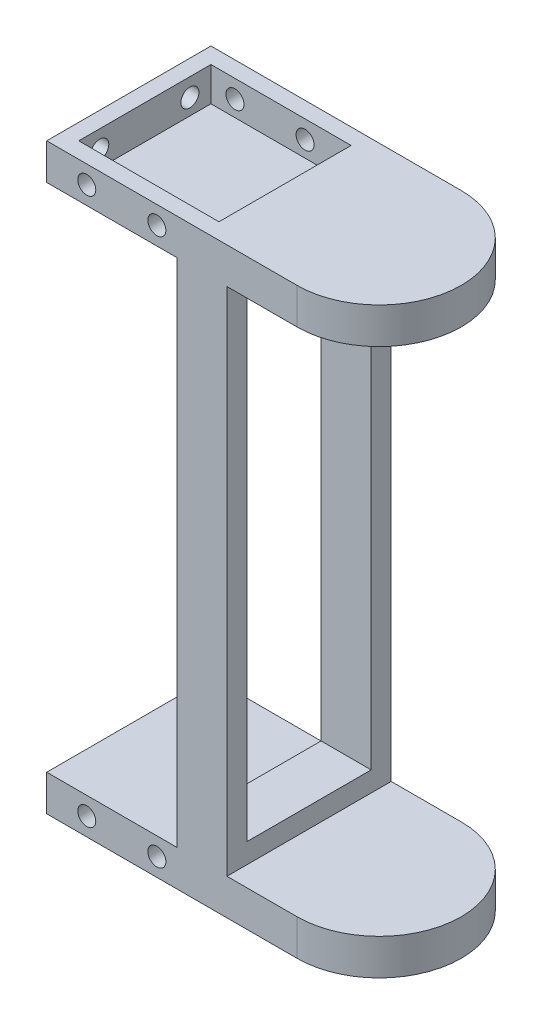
ISO-10303-21;
HEADER;
FILE_DESCRIPTION(('STEP AP214'),'2;1');
FILE_NAME('part.step','',(''),(''),'','','');
FILE_SCHEMA(('AUTOMOTIVE_DESIGN { 1 0 10303 214 1 1 1 1 }'));
ENDSEC;
DATA;
#1=APPLICATION_CONTEXT('core data for automotive mechanical design processes');
#2=APPLICATION_PROTOCOL_DEFINITION('international standard','automotive_design',2000,#1);
#3=PRODUCT_CONTEXT('',#1,'mechanical');
#4=PRODUCT('Part','Part','',(#3));
#5=PRODUCT_RELATED_PRODUCT_CATEGORY('part','',(#4));
#6=PRODUCT_DEFINITION_FORMATION('','',#4);
#7=PRODUCT_DEFINITION_CONTEXT('part definition',#1,'design');
#8=PRODUCT_DEFINITION('design','',#6,#7);
#9=PRODUCT_DEFINITION_SHAPE('','',#8);
#10=(LENGTH_UNIT() NAMED_UNIT(*) SI_UNIT(.MILLI.,.METRE.));
#11=(NAMED_UNIT(*) PLANE_ANGLE_UNIT() SI_UNIT($,.RADIAN.));
#12=(NAMED_UNIT(*) SI_UNIT($,.STERADIAN.) SOLID_ANGLE_UNIT());
#13=UNCERTAINTY_MEASURE_WITH_UNIT(LENGTH_MEASURE(1.E-05),#10,'distance_accuracy_value','');
#14=(GEOMETRIC_REPRESENTATION_CONTEXT(3) GLOBAL_UNCERTAINTY_ASSIGNED_CONTEXT((#13)) GLOBAL_UNIT_ASSIGNED_CONTEXT((#10,
#11,#12)) REPRESENTATION_CONTEXT('',''));
#15=CARTESIAN_POINT('',(0.,0.,0.));
#16=DIRECTION('',(0.,0.,1.));
#17=DIRECTION('',(1.,0.,0.));
#18=AXIS2_PLACEMENT_3D('',#15,#16,#17);
#19=CARTESIAN_POINT('',(-63.5,145.5,-41.));
#20=DIRECTION('',(1.,0.,0.));
#21=DIRECTION('',(0.,0.,-1.));
#22=AXIS2_PLACEMENT_3D('',#19,#20,#21);
#23=PLANE('',#22);
#24=CARTESIAN_POINT('',(-63.5,136.5,22.5));
#25=DIRECTION('',(-1.,0.,0.));
#26=DIRECTION('',(0.,0.,-1.));
#27=AXIS2_PLACEMENT_3D('',#24,#25,#26);
#28=CIRCLE('',#27,4.50000000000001);
#29=CARTESIAN_POINT('',(-63.5,136.5,18.));
#30=VERTEX_POINT('',#29);
#31=EDGE_CURVE('E241',#30,#30,#28,.T.);
#32=ORIENTED_EDGE('',*,*,#31,.F.);
#33=EDGE_LOOP('',(#32));
#34=FACE_BOUND('',#33,.T.);
#35=CARTESIAN_POINT('',(-63.5,136.5,-22.5));
#36=DIRECTION('',(-1.,0.,0.));
#37=DIRECTION('',(0.,0.,1.));
#38=AXIS2_PLACEMENT_3D('',#35,#36,#37);
#39=CIRCLE('',#38,4.50000000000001);
#40=CARTESIAN_POINT('',(-63.5,136.5,-18.));
#41=VERTEX_POINT('',#40);
#42=EDGE_CURVE('E247',#41,#41,#39,.T.);
#43=ORIENTED_EDGE('',*,*,#42,.F.);
#44=EDGE_LOOP('',(#43));
#45=FACE_BOUND('',#44,.T.);
#46=DIRECTION('',(0.,-1.,0.));
#47=VECTOR('',#46,1.);
#48=CARTESIAN_POINT('',(-63.5,145.5,-41.));
#49=LINE('',#48,#47);
#50=CARTESIAN_POINT('',(-63.5,145.5,-41.));
#51=VERTEX_POINT('',#50);
#52=CARTESIAN_POINT('',(-63.5,127.5,-41.));
#53=VERTEX_POINT('',#52);
#54=EDGE_CURVE('E423',#51,#53,#49,.T.);
#55=ORIENTED_EDGE('',*,*,#54,.T.);
#56=DIRECTION('',(0.,0.,1.));
#57=VECTOR('',#56,1.);
#58=CARTESIAN_POINT('',(-63.5,127.5,-41.));
#59=LINE('',#58,#57);
#60=CARTESIAN_POINT('',(-63.5,127.5,41.));
#61=VERTEX_POINT('',#60);
#62=EDGE_CURVE('E370',#53,#61,#59,.T.);
#63=ORIENTED_EDGE('',*,*,#62,.T.);
#64=DIRECTION('',(0.,-1.,0.));
#65=VECTOR('',#64,1.);
#66=CARTESIAN_POINT('',(-63.5,145.5,41.));
#67=LINE('',#66,#65);
#68=CARTESIAN_POINT('',(-63.5,145.5,41.));
#69=VERTEX_POINT('',#68);
#70=EDGE_CURVE('E38',#69,#61,#67,.T.);
#71=ORIENTED_EDGE('',*,*,#70,.F.);
#72=DIRECTION('',(0.,0.,1.));
#73=VECTOR('',#72,1.);
#74=CARTESIAN_POINT('',(-63.5,145.5,-41.));
#75=LINE('',#74,#73);
#76=EDGE_CURVE('E413',#51,#69,#75,.T.);
#77=ORIENTED_EDGE('',*,*,#76,.F.);
#78=EDGE_LOOP('',(#55,#63,#71,#77));
#79=FACE_BOUND('',#78,.T.);
#80=ADVANCED_FACE('F29',(#34,#45,#79),#23,.F.);
#81=CARTESIAN_POINT('',(61.5,145.5,0.));
#82=DIRECTION('',(0.,-1.,0.));
#83=DIRECTION('',(0.,0.,-1.));
#84=AXIS2_PLACEMENT_3D('',#81,#82,#83);
#85=CYLINDRICAL_SURFACE('',#84,41.);
#86=DIRECTION('',(0.,-1.,0.));
#87=VECTOR('',#86,1.);
#88=CARTESIAN_POINT('',(61.5,145.5,-41.));
#89=LINE('',#88,#87);
#90=CARTESIAN_POINT('',(61.5,-127.5,-41.));
#91=VERTEX_POINT('',#90);
#92=CARTESIAN_POINT('',(61.5,-145.5,-41.));
#93=VERTEX_POINT('',#92);
#94=EDGE_CURVE('E426',#91,#93,#89,.T.);
#95=ORIENTED_EDGE('',*,*,#94,.F.);
#96=CARTESIAN_POINT('',(61.5,-127.5,0.));
#97=DIRECTION('',(0.,-1.,0.));
#98=DIRECTION('',(0.,0.,-1.));
#99=AXIS2_PLACEMENT_3D('',#96,#97,#98);
#100=CIRCLE('',#99,41.);
#101=CARTESIAN_POINT('',(61.5,-127.5,41.));
#102=VERTEX_POINT('',#101);
#103=EDGE_CURVE('E399',#91,#102,#100,.T.);
#104=ORIENTED_EDGE('',*,*,#103,.T.);
#105=DIRECTION('',(0.,-1.,0.));
#106=VECTOR('',#105,1.);
#107=CARTESIAN_POINT('',(61.5,145.5,41.));
#108=LINE('',#107,#106);
#109=CARTESIAN_POINT('',(61.5,-145.5,41.));
#110=VERTEX_POINT('',#109);
#111=EDGE_CURVE('E430',#102,#110,#108,.T.);
#112=ORIENTED_EDGE('',*,*,#111,.T.);
#113=CARTESIAN_POINT('',(61.5,-145.5,0.));
#114=DIRECTION('',(0.,1.,0.));
#115=DIRECTION('',(0.,0.,1.));
#116=AXIS2_PLACEMENT_3D('',#113,#114,#115);
#117=CIRCLE('',#116,41.);
#118=EDGE_CURVE('E407',#110,#93,#117,.T.);
#119=ORIENTED_EDGE('',*,*,#118,.T.);
#120=EDGE_LOOP('',(#95,#104,#112,#119));
#121=FACE_BOUND('',#120,.T.);
#122=ADVANCED_FACE('F464',(#121),#85,.T.);
#123=CARTESIAN_POINT('',(-63.5,-136.5,-22.5));
#124=DIRECTION('',(-1.,0.,0.));
#125=DIRECTION('',(0.,0.,-1.));
#126=AXIS2_PLACEMENT_3D('',#123,#124,#125);
#127=CIRCLE('',#126,4.50000000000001);
#128=CARTESIAN_POINT('',(-63.5,-136.5,-27.));
#129=VERTEX_POINT('',#128);
#130=EDGE_CURVE('E229',#129,#129,#127,.T.);
#131=ORIENTED_EDGE('',*,*,#130,.F.);
#132=EDGE_LOOP('',(#131));
#133=FACE_BOUND('',#132,.T.);
#134=CARTESIAN_POINT('',(-63.5,-136.5,22.5));
#135=DIRECTION('',(-1.,0.,0.));
#136=DIRECTION('',(0.,0.,1.));
#137=AXIS2_PLACEMENT_3D('',#134,#135,#136);
#138=CIRCLE('',#137,4.50000000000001);
#139=CARTESIAN_POINT('',(-63.5,-136.5,27.));
#140=VERTEX_POINT('',#139);
#141=EDGE_CURVE('E235',#140,#140,#138,.T.);
#142=ORIENTED_EDGE('',*,*,#141,.F.);
#143=EDGE_LOOP('',(#142));
#144=FACE_BOUND('',#143,.T.);
#145=CARTESIAN_POINT('',(-63.5,-127.5,41.));
#146=VERTEX_POINT('',#145);
#147=CARTESIAN_POINT('',(-63.5,-145.5,41.));
#148=VERTEX_POINT('',#147);
#149=EDGE_CURVE('E434',#146,#148,#67,.T.);
#150=ORIENTED_EDGE('',*,*,#149,.F.);
#151=DIRECTION('',(0.,0.,1.));
#152=VECTOR('',#151,1.);
#153=CARTESIAN_POINT('',(-63.5,-127.5,-41.));
#154=LINE('',#153,#152);
#155=CARTESIAN_POINT('',(-63.5,-127.5,-41.));
#156=VERTEX_POINT('',#155);
#157=EDGE_CURVE('E369',#156,#146,#154,.T.);
#158=ORIENTED_EDGE('',*,*,#157,.F.);
#159=CARTESIAN_POINT('',(-63.5,-145.5,-41.));
#160=VERTEX_POINT('',#159);
#161=EDGE_CURVE('E422',#156,#160,#49,.T.);
#162=ORIENTED_EDGE('',*,*,#161,.T.);
#163=DIRECTION('',(0.,0.,1.));
#164=VECTOR('',#163,1.);
#165=CARTESIAN_POINT('',(-63.5,-145.5,-41.));
#166=LINE('',#165,#164);
#167=EDGE_CURVE('E401',#160,#148,#166,.T.);
#168=ORIENTED_EDGE('',*,*,#167,.T.);
#169=EDGE_LOOP('',(#150,#158,#162,#168));
#170=FACE_BOUND('',#169,.T.);
#171=ADVANCED_FACE('F31',(#133,#144,#170),#23,.F.);
#172=CARTESIAN_POINT('',(-63.5,145.5,41.));
#173=DIRECTION('',(0.,0.,-1.));
#174=DIRECTION('',(-1.,0.,0.));
#175=AXIS2_PLACEMENT_3D('',#172,#173,#174);
#176=PLANE('',#175);
#177=CARTESIAN_POINT('',(-43.5,-136.5,41.));
#178=DIRECTION('',(0.,0.,1.));
#179=DIRECTION('',(-1.,0.,0.));
#180=AXIS2_PLACEMENT_3D('',#177,#178,#179);
#181=CIRCLE('',#180,4.50000000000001);
#182=CARTESIAN_POINT('',(-48.,-136.5,41.));
#183=VERTEX_POINT('',#182);
#184=EDGE_CURVE('E253',#183,#183,#181,.T.);
#185=ORIENTED_EDGE('',*,*,#184,.F.);
#186=EDGE_LOOP('',(#185));
#187=FACE_BOUND('',#186,.T.);
#188=CARTESIAN_POINT('',(-8.49999999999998,136.5,41.));
#189=DIRECTION('',(0.,0.,1.));
#190=DIRECTION('',(1.,0.,0.));
#191=AXIS2_PLACEMENT_3D('',#188,#189,#190);
#192=CIRCLE('',#191,4.50000000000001);
#193=CARTESIAN_POINT('',(-3.99999999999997,136.5,41.));
#194=VERTEX_POINT('',#193);
#195=EDGE_CURVE('E262',#194,#194,#192,.T.);
#196=ORIENTED_EDGE('',*,*,#195,.F.);
#197=EDGE_LOOP('',(#196));
#198=FACE_BOUND('',#197,.T.);
#199=CARTESIAN_POINT('',(-43.5,136.5,41.));
#200=DIRECTION('',(0.,0.,1.));
#201=DIRECTION('',(1.,0.,0.));
#202=AXIS2_PLACEMENT_3D('',#199,#200,#201);
#203=CIRCLE('',#202,4.50000000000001);
#204=CARTESIAN_POINT('',(-39.,136.5,41.));
#205=VERTEX_POINT('',#204);
#206=EDGE_CURVE('E272',#205,#205,#203,.T.);
#207=ORIENTED_EDGE('',*,*,#206,.F.);
#208=EDGE_LOOP('',(#207));
#209=FACE_BOUND('',#208,.T.);
#210=CARTESIAN_POINT('',(-8.49999999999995,-136.5,41.));
#211=DIRECTION('',(0.,0.,1.));
#212=DIRECTION('',(-1.,0.,0.));
#213=AXIS2_PLACEMENT_3D('',#210,#211,#212);
#214=CIRCLE('',#213,4.50000000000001);
#215=CARTESIAN_POINT('',(-13.,-136.5,41.));
#216=VERTEX_POINT('',#215);
#217=EDGE_CURVE('E282',#216,#216,#214,.T.);
#218=ORIENTED_EDGE('',*,*,#217,.F.);
#219=EDGE_LOOP('',(#218));
#220=FACE_BOUND('',#219,.T.);
#221=ORIENTED_EDGE('',*,*,#70,.T.);
#222=DIRECTION('',(-1.,0.,0.));
#223=VECTOR('',#222,1.);
#224=CARTESIAN_POINT('',(-63.5,127.5,41.));
#225=LINE('',#224,#223);
#226=CARTESIAN_POINT('',(1.50000000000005,127.5,41.));
#227=VERTEX_POINT('',#226);
#228=EDGE_CURVE('E358',#227,#61,#225,.T.);
#229=ORIENTED_EDGE('',*,*,#228,.F.);
#230=DIRECTION('',(0.,1.,0.));
#231=VECTOR('',#230,1.);
#232=CARTESIAN_POINT('',(1.50000000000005,127.5,41.));
#233=LINE('',#232,#231);
#234=CARTESIAN_POINT('',(1.50000000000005,-127.5,41.));
#235=VERTEX_POINT('',#234);
#236=EDGE_CURVE('E355',#235,#227,#233,.T.);
#237=ORIENTED_EDGE('',*,*,#236,.F.);
#238=DIRECTION('',(1.,0.,0.));
#239=VECTOR('',#238,1.);
#240=CARTESIAN_POINT('',(-63.5,-127.5,41.));
#241=LINE('',#240,#239);
#242=EDGE_CURVE('E352',#146,#235,#241,.T.);
#243=ORIENTED_EDGE('',*,*,#242,.F.);
#244=ORIENTED_EDGE('',*,*,#149,.T.);
#245=DIRECTION('',(1.,0.,0.));
#246=VECTOR('',#245,1.);
#247=CARTESIAN_POINT('',(-63.5,-145.5,41.));
#248=LINE('',#247,#246);
#249=EDGE_CURVE('E404',#148,#110,#248,.T.);
#250=ORIENTED_EDGE('',*,*,#249,.T.);
#251=ORIENTED_EDGE('',*,*,#111,.F.);
#252=DIRECTION('',(1.,0.,0.));
#253=VECTOR('',#252,1.);
#254=CARTESIAN_POINT('',(102.5,-127.5,41.));
#255=LINE('',#254,#253);
#256=CARTESIAN_POINT('',(26.5,-127.5,41.));
#257=VERTEX_POINT('',#256);
#258=EDGE_CURVE('E383',#257,#102,#255,.T.);
#259=ORIENTED_EDGE('',*,*,#258,.F.);
#260=DIRECTION('',(0.,-1.,0.));
#261=VECTOR('',#260,1.);
#262=CARTESIAN_POINT('',(26.5,127.5,41.));
#263=LINE('',#262,#261);
#264=CARTESIAN_POINT('',(26.5,127.5,41.));
#265=VERTEX_POINT('',#264);
#266=EDGE_CURVE('E380',#265,#257,#263,.T.);
#267=ORIENTED_EDGE('',*,*,#266,.F.);
#268=DIRECTION('',(-1.,0.,0.));
#269=VECTOR('',#268,1.);
#270=CARTESIAN_POINT('',(102.5,127.5,41.));
#271=LINE('',#270,#269);
#272=CARTESIAN_POINT('',(61.5,127.5,41.));
#273=VERTEX_POINT('',#272);
#274=EDGE_CURVE('E373',#273,#265,#271,.T.);
#275=ORIENTED_EDGE('',*,*,#274,.F.);
#276=CARTESIAN_POINT('',(61.5,145.5,41.));
#277=VERTEX_POINT('',#276);
#278=EDGE_CURVE('E431',#277,#273,#108,.T.);
#279=ORIENTED_EDGE('',*,*,#278,.F.);
#280=DIRECTION('',(1.,0.,0.));
#281=VECTOR('',#280,1.);
#282=CARTESIAN_POINT('',(-63.5,145.5,41.));
#283=LINE('',#282,#281);
#284=EDGE_CURVE('E416',#69,#277,#283,.T.);
#285=ORIENTED_EDGE('',*,*,#284,.F.);
#286=EDGE_LOOP('',(#221,#229,#237,#243,#244,#250,#251,#259,#267,#275,#279,#285));
#287=FACE_BOUND('',#286,.T.);
#288=ADVANCED_FACE('F476',(#187,#198,#209,#220,#287),#176,.F.);
#289=ORIENTED_EDGE('',*,*,#278,.T.);
#290=CARTESIAN_POINT('',(61.5,127.5,0.));
#291=DIRECTION('',(0.,1.,0.));
#292=DIRECTION('',(0.,0.,1.));
#293=AXIS2_PLACEMENT_3D('',#290,#291,#292);
#294=CIRCLE('',#293,41.);
#295=CARTESIAN_POINT('',(61.5,127.5,-41.));
#296=VERTEX_POINT('',#295);
#297=EDGE_CURVE('E395',#273,#296,#294,.T.);
#298=ORIENTED_EDGE('',*,*,#297,.T.);
#299=CARTESIAN_POINT('',(61.5,145.5,-41.));
#300=VERTEX_POINT('',#299);
#301=EDGE_CURVE('E427',#300,#296,#89,.T.);
#302=ORIENTED_EDGE('',*,*,#301,.F.);
#303=CARTESIAN_POINT('',(61.5,145.5,0.));
#304=DIRECTION('',(0.,1.,0.));
#305=DIRECTION('',(0.,0.,1.));
#306=AXIS2_PLACEMENT_3D('',#303,#304,#305);
#307=CIRCLE('',#306,41.);
#308=EDGE_CURVE('E418',#277,#300,#307,.T.);
#309=ORIENTED_EDGE('',*,*,#308,.F.);
#310=EDGE_LOOP('',(#289,#298,#302,#309));
#311=FACE_BOUND('',#310,.T.);
#312=ADVANCED_FACE('F473',(#311),#85,.T.);
#313=CARTESIAN_POINT('',(-63.5,145.5,-41.));
#314=DIRECTION('',(0.,0.,1.));
#315=DIRECTION('',(1.,0.,0.));
#316=AXIS2_PLACEMENT_3D('',#313,#314,#315);
#317=PLANE('',#316);
#318=CARTESIAN_POINT('',(-43.5,-136.5,-41.));
#319=DIRECTION('',(0.,0.,1.));
#320=DIRECTION('',(-1.,0.,0.));
#321=AXIS2_PLACEMENT_3D('',#318,#319,#320);
#322=CIRCLE('',#321,4.50000000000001);
#323=CARTESIAN_POINT('',(-48.,-136.5,-41.));
#324=VERTEX_POINT('',#323);
#325=EDGE_CURVE('E256',#324,#324,#322,.T.);
#326=ORIENTED_EDGE('',*,*,#325,.T.);
#327=EDGE_LOOP('',(#326));
#328=FACE_BOUND('',#327,.T.);
#329=CARTESIAN_POINT('',(-8.49999999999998,136.5,-41.));
#330=DIRECTION('',(0.,0.,1.));
#331=DIRECTION('',(1.,0.,0.));
#332=AXIS2_PLACEMENT_3D('',#329,#330,#331);
#333=CIRCLE('',#332,4.50000000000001);
#334=CARTESIAN_POINT('',(-3.99999999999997,136.5,-41.));
#335=VERTEX_POINT('',#334);
#336=EDGE_CURVE('E265',#335,#335,#333,.T.);
#337=ORIENTED_EDGE('',*,*,#336,.T.);
#338=EDGE_LOOP('',(#337));
#339=FACE_BOUND('',#338,.T.);
#340=CARTESIAN_POINT('',(-43.5,136.5,-41.));
#341=DIRECTION('',(0.,0.,1.));
#342=DIRECTION('',(1.,0.,0.));
#343=AXIS2_PLACEMENT_3D('',#340,#341,#342);
#344=CIRCLE('',#343,4.50000000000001);
#345=CARTESIAN_POINT('',(-39.,136.5,-41.));
#346=VERTEX_POINT('',#345);
#347=EDGE_CURVE('E275',#346,#346,#344,.T.);
#348=ORIENTED_EDGE('',*,*,#347,.T.);
#349=EDGE_LOOP('',(#348));
#350=FACE_BOUND('',#349,.T.);
#351=CARTESIAN_POINT('',(-8.49999999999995,-136.5,-41.));
#352=DIRECTION('',(0.,0.,1.));
#353=DIRECTION('',(-1.,0.,0.));
#354=AXIS2_PLACEMENT_3D('',#351,#352,#353);
#355=CIRCLE('',#354,4.50000000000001);
#356=CARTESIAN_POINT('',(-13.,-136.5,-41.));
#357=VERTEX_POINT('',#356);
#358=EDGE_CURVE('E285',#357,#357,#355,.T.);
#359=ORIENTED_EDGE('',*,*,#358,.T.);
#360=EDGE_LOOP('',(#359));
#361=FACE_BOUND('',#360,.T.);
#362=DIRECTION('',(0.,1.,0.));
#363=VECTOR('',#362,1.);
#364=CARTESIAN_POINT('',(1.50000000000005,127.5,-41.));
#365=LINE('',#364,#363);
#366=CARTESIAN_POINT('',(1.50000000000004,-127.5,-41.));
#367=VERTEX_POINT('',#366);
#368=CARTESIAN_POINT('',(1.50000000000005,127.5,-41.));
#369=VERTEX_POINT('',#368);
#370=EDGE_CURVE('E363',#367,#369,#365,.T.);
#371=ORIENTED_EDGE('',*,*,#370,.T.);
#372=DIRECTION('',(-1.,0.,0.));
#373=VECTOR('',#372,1.);
#374=CARTESIAN_POINT('',(-63.5,127.5,-41.));
#375=LINE('',#374,#373);
#376=EDGE_CURVE('E366',#369,#53,#375,.T.);
#377=ORIENTED_EDGE('',*,*,#376,.T.);
#378=ORIENTED_EDGE('',*,*,#54,.F.);
#379=DIRECTION('',(-1.,0.,0.));
#380=VECTOR('',#379,1.);
#381=CARTESIAN_POINT('',(-63.5,145.5,-41.));
#382=LINE('',#381,#380);
#383=EDGE_CURVE('E420',#300,#51,#382,.T.);
#384=ORIENTED_EDGE('',*,*,#383,.F.);
#385=ORIENTED_EDGE('',*,*,#301,.T.);
#386=DIRECTION('',(-1.,0.,0.));
#387=VECTOR('',#386,1.);
#388=CARTESIAN_POINT('',(-63.5,127.5,-41.));
#389=LINE('',#388,#387);
#390=CARTESIAN_POINT('',(26.5,127.5,-41.));
#391=VERTEX_POINT('',#390);
#392=EDGE_CURVE('E12',#296,#391,#389,.T.);
#393=ORIENTED_EDGE('',*,*,#392,.T.);
#394=DIRECTION('',(0.,-1.,0.));
#395=VECTOR('',#394,1.);
#396=CARTESIAN_POINT('',(26.5,127.5,-41.));
#397=LINE('',#396,#395);
#398=CARTESIAN_POINT('',(26.5,-127.5,-41.));
#399=VERTEX_POINT('',#398);
#400=EDGE_CURVE('E386',#391,#399,#397,.T.);
#401=ORIENTED_EDGE('',*,*,#400,.T.);
#402=DIRECTION('',(1.,0.,0.));
#403=VECTOR('',#402,1.);
#404=CARTESIAN_POINT('',(102.5,-127.5,-41.));
#405=LINE('',#404,#403);
#406=EDGE_CURVE('E389',#399,#91,#405,.T.);
#407=ORIENTED_EDGE('',*,*,#406,.T.);
#408=ORIENTED_EDGE('',*,*,#94,.T.);
#409=DIRECTION('',(-1.,0.,0.));
#410=VECTOR('',#409,1.);
#411=CARTESIAN_POINT('',(-63.5,-145.5,-41.));
#412=LINE('',#411,#410);
#413=EDGE_CURVE('E410',#93,#160,#412,.T.);
#414=ORIENTED_EDGE('',*,*,#413,.T.);
#415=ORIENTED_EDGE('',*,*,#161,.F.);
#416=DIRECTION('',(1.,0.,0.));
#417=VECTOR('',#416,1.);
#418=CARTESIAN_POINT('',(-63.5,-127.5,-41.));
#419=LINE('',#418,#417);
#420=EDGE_CURVE('E360',#156,#367,#419,.T.);
#421=ORIENTED_EDGE('',*,*,#420,.T.);
#422=EDGE_LOOP('',(#371,#377,#378,#384,#385,#393,#401,#407,#408,#414,#415,#421));
#423=FACE_BOUND('',#422,.T.);
#424=ADVANCED_FACE('F514',(#328,#339,#350,#361,#423),#317,.F.);
#425=CARTESIAN_POINT('',(61.5,145.5,0.));
#426=DIRECTION('',(0.,1.,0.));
#427=DIRECTION('',(0.,0.,1.));
#428=AXIS2_PLACEMENT_3D('',#425,#426,#427);
#429=PLANE('',#428);
#430=DIRECTION('',(0.,0.,-1.));
#431=VECTOR('',#430,1.);
#432=CARTESIAN_POINT('',(-55.5,145.5,33.));
#433=LINE('',#432,#431);
#434=CARTESIAN_POINT('',(-55.5,145.5,33.));
#435=VERTEX_POINT('',#434);
#436=CARTESIAN_POINT('',(-55.5,145.5,-33.));
#437=VERTEX_POINT('',#436);
#438=EDGE_CURVE('E321',#435,#437,#433,.T.);
#439=ORIENTED_EDGE('',*,*,#438,.T.);
#440=DIRECTION('',(1.,0.,0.));
#441=VECTOR('',#440,1.);
#442=CARTESIAN_POINT('',(-55.5,145.5,-33.));
#443=LINE('',#442,#441);
#444=CARTESIAN_POINT('',(14.5,145.5,-33.));
#445=VERTEX_POINT('',#444);
#446=EDGE_CURVE('E292',#437,#445,#443,.T.);
#447=ORIENTED_EDGE('',*,*,#446,.T.);
#448=DIRECTION('',(0.,0.,1.));
#449=VECTOR('',#448,1.);
#450=CARTESIAN_POINT('',(14.5,145.5,33.));
#451=LINE('',#450,#449);
#452=CARTESIAN_POINT('',(14.5,145.5,33.));
#453=VERTEX_POINT('',#452);
#454=EDGE_CURVE('E311',#445,#453,#451,.T.);
#455=ORIENTED_EDGE('',*,*,#454,.T.);
#456=DIRECTION('',(-1.,0.,0.));
#457=VECTOR('',#456,1.);
#458=CARTESIAN_POINT('',(-55.5,145.5,33.));
#459=LINE('',#458,#457);
#460=EDGE_CURVE('E316',#453,#435,#459,.T.);
#461=ORIENTED_EDGE('',*,*,#460,.T.);
#462=EDGE_LOOP('',(#439,#447,#455,#461));
#463=FACE_BOUND('',#462,.T.);
#464=ORIENTED_EDGE('',*,*,#76,.T.);
#465=ORIENTED_EDGE('',*,*,#284,.T.);
#466=ORIENTED_EDGE('',*,*,#308,.T.);
#467=ORIENTED_EDGE('',*,*,#383,.T.);
#468=EDGE_LOOP('',(#464,#465,#466,#467));
#469=FACE_BOUND('',#468,.T.);
#470=ADVANCED_FACE('F525',(#463,#469),#429,.T.);
#471=CARTESIAN_POINT('',(61.5,-145.5,0.));
#472=DIRECTION('',(0.,1.,0.));
#473=DIRECTION('',(0.,0.,1.));
#474=AXIS2_PLACEMENT_3D('',#471,#472,#473);
#475=PLANE('',#474);
#476=DIRECTION('',(1.,0.,0.));
#477=VECTOR('',#476,1.);
#478=CARTESIAN_POINT('',(-55.5,-145.5,-33.));
#479=LINE('',#478,#477);
#480=CARTESIAN_POINT('',(-55.5,-145.5,-33.));
#481=VERTEX_POINT('',#480);
#482=CARTESIAN_POINT('',(14.5,-145.5,-33.));
#483=VERTEX_POINT('',#482);
#484=EDGE_CURVE('E334',#481,#483,#479,.T.);
#485=ORIENTED_EDGE('',*,*,#484,.F.);
#486=DIRECTION('',(0.,0.,-1.));
#487=VECTOR('',#486,1.);
#488=CARTESIAN_POINT('',(-55.5,-145.5,33.));
#489=LINE('',#488,#487);
#490=CARTESIAN_POINT('',(-55.5,-145.5,33.));
#491=VERTEX_POINT('',#490);
#492=EDGE_CURVE('E324',#491,#481,#489,.T.);
#493=ORIENTED_EDGE('',*,*,#492,.F.);
#494=DIRECTION('',(-1.,0.,0.));
#495=VECTOR('',#494,1.);
#496=CARTESIAN_POINT('',(-55.5,-145.5,33.));
#497=LINE('',#496,#495);
#498=CARTESIAN_POINT('',(14.5,-145.5,33.));
#499=VERTEX_POINT('',#498);
#500=EDGE_CURVE('E340',#499,#491,#497,.T.);
#501=ORIENTED_EDGE('',*,*,#500,.F.);
#502=DIRECTION('',(0.,0.,1.));
#503=VECTOR('',#502,1.);
#504=CARTESIAN_POINT('',(14.5,-145.5,33.));
#505=LINE('',#504,#503);
#506=EDGE_CURVE('E337',#483,#499,#505,.T.);
#507=ORIENTED_EDGE('',*,*,#506,.F.);
#508=EDGE_LOOP('',(#485,#493,#501,#507));
#509=FACE_BOUND('',#508,.T.);
#510=ORIENTED_EDGE('',*,*,#167,.F.);
#511=ORIENTED_EDGE('',*,*,#413,.F.);
#512=ORIENTED_EDGE('',*,*,#118,.F.);
#513=ORIENTED_EDGE('',*,*,#249,.F.);
#514=EDGE_LOOP('',(#510,#511,#512,#513));
#515=FACE_BOUND('',#514,.T.);
#516=ADVANCED_FACE('F498',(#509,#515),#475,.F.);
#517=CARTESIAN_POINT('',(102.5,-127.5,-41.));
#518=DIRECTION('',(0.,-1.,0.));
#519=DIRECTION('',(0.,0.,-1.));
#520=AXIS2_PLACEMENT_3D('',#517,#518,#519);
#521=PLANE('',#520);
#522=ORIENTED_EDGE('',*,*,#406,.F.);
#523=DIRECTION('',(0.,0.,1.));
#524=VECTOR('',#523,1.);
#525=CARTESIAN_POINT('',(26.5,-127.5,-41.));
#526=LINE('',#525,#524);
#527=EDGE_CURVE('E393',#399,#257,#526,.T.);
#528=ORIENTED_EDGE('',*,*,#527,.T.);
#529=ORIENTED_EDGE('',*,*,#258,.T.);
#530=ORIENTED_EDGE('',*,*,#103,.F.);
#531=EDGE_LOOP('',(#522,#528,#529,#530));
#532=FACE_BOUND('',#531,.T.);
#533=ADVANCED_FACE('F506',(#532),#521,.F.);
#534=CARTESIAN_POINT('',(102.5,127.5,-41.));
#535=DIRECTION('',(0.,1.,0.));
#536=DIRECTION('',(0.,0.,1.));
#537=AXIS2_PLACEMENT_3D('',#534,#535,#536);
#538=PLANE('',#537);
#539=ORIENTED_EDGE('',*,*,#274,.T.);
#540=DIRECTION('',(0.,0.,1.));
#541=VECTOR('',#540,1.);
#542=CARTESIAN_POINT('',(26.5,127.5,-41.));
#543=LINE('',#542,#541);
#544=EDGE_CURVE('E392',#391,#265,#543,.T.);
#545=ORIENTED_EDGE('',*,*,#544,.F.);
#546=ORIENTED_EDGE('',*,*,#392,.F.);
#547=ORIENTED_EDGE('',*,*,#297,.F.);
#548=EDGE_LOOP('',(#539,#545,#546,#547));
#549=FACE_BOUND('',#548,.T.);
#550=ADVANCED_FACE('F512',(#549),#538,.F.);
#551=CARTESIAN_POINT('',(26.5,127.5,-41.));
#552=DIRECTION('',(-1.,0.,0.));
#553=DIRECTION('',(0.,0.,1.));
#554=AXIS2_PLACEMENT_3D('',#551,#552,#553);
#555=PLANE('',#554);
#556=DIRECTION('',(0.,0.,-1.));
#557=VECTOR('',#556,1.);
#558=CARTESIAN_POINT('',(26.5,117.5,-41.));
#559=LINE('',#558,#557);
#560=CARTESIAN_POINT('',(26.5000000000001,117.5,31.));
#561=VERTEX_POINT('',#560);
#562=CARTESIAN_POINT('',(26.5000000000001,117.5,-31.));
#563=VERTEX_POINT('',#562);
#564=EDGE_CURVE('E223',#561,#563,#559,.T.);
#565=ORIENTED_EDGE('',*,*,#564,.T.);
#566=DIRECTION('',(0.,-1.,0.));
#567=VECTOR('',#566,1.);
#568=CARTESIAN_POINT('',(26.5,127.5,-31.));
#569=LINE('',#568,#567);
#570=CARTESIAN_POINT('',(26.5000000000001,-117.5,-31.));
#571=VERTEX_POINT('',#570);
#572=EDGE_CURVE('E226',#563,#571,#569,.T.);
#573=ORIENTED_EDGE('',*,*,#572,.T.);
#574=DIRECTION('',(0.,0.,1.));
#575=VECTOR('',#574,1.);
#576=CARTESIAN_POINT('',(26.5,-117.5,-41.0000000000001));
#577=LINE('',#576,#575);
#578=CARTESIAN_POINT('',(26.5,-117.5,31.));
#579=VERTEX_POINT('',#578);
#580=EDGE_CURVE('E218',#571,#579,#577,.T.);
#581=ORIENTED_EDGE('',*,*,#580,.T.);
#582=DIRECTION('',(0.,1.,0.));
#583=VECTOR('',#582,1.);
#584=CARTESIAN_POINT('',(26.5,127.5,31.));
#585=LINE('',#584,#583);
#586=EDGE_CURVE('E198',#579,#561,#585,.T.);
#587=ORIENTED_EDGE('',*,*,#586,.T.);
#588=EDGE_LOOP('',(#565,#573,#581,#587));
#589=FACE_BOUND('',#588,.T.);
#590=ORIENTED_EDGE('',*,*,#266,.T.);
#591=ORIENTED_EDGE('',*,*,#527,.F.);
#592=ORIENTED_EDGE('',*,*,#400,.F.);
#593=ORIENTED_EDGE('',*,*,#544,.T.);
#594=EDGE_LOOP('',(#590,#591,#592,#593));
#595=FACE_BOUND('',#594,.T.);
#596=ADVANCED_FACE('F508',(#589,#595),#555,.F.);
#597=CARTESIAN_POINT('',(-63.5,127.5,-41.));
#598=DIRECTION('',(0.,1.,0.));
#599=DIRECTION('',(0.,0.,1.));
#600=AXIS2_PLACEMENT_3D('',#597,#598,#599);
#601=PLANE('',#600);
#602=ORIENTED_EDGE('',*,*,#228,.T.);
#603=ORIENTED_EDGE('',*,*,#62,.F.);
#604=ORIENTED_EDGE('',*,*,#376,.F.);
#605=DIRECTION('',(0.,0.,1.));
#606=VECTOR('',#605,1.);
#607=CARTESIAN_POINT('',(1.50000000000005,127.5,-41.));
#608=LINE('',#607,#606);
#609=EDGE_CURVE('E374',#369,#227,#608,.T.);
#610=ORIENTED_EDGE('',*,*,#609,.T.);
#611=EDGE_LOOP('',(#602,#603,#604,#610));
#612=FACE_BOUND('',#611,.T.);
#613=ADVANCED_FACE('F529',(#612),#601,.F.);
#614=CARTESIAN_POINT('',(1.50000000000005,127.5,-41.));
#615=DIRECTION('',(1.,0.,0.));
#616=DIRECTION('',(0.,0.,-1.));
#617=AXIS2_PLACEMENT_3D('',#614,#615,#616);
#618=PLANE('',#617);
#619=DIRECTION('',(0.,0.,1.));
#620=VECTOR('',#619,1.);
#621=CARTESIAN_POINT('',(1.50000000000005,-117.5,-31.));
#622=LINE('',#621,#620);
#623=CARTESIAN_POINT('',(1.50000000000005,-117.5,-31.));
#624=VERTEX_POINT('',#623);
#625=CARTESIAN_POINT('',(1.50000000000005,-117.5,31.));
#626=VERTEX_POINT('',#625);
#627=EDGE_CURVE('E204',#624,#626,#622,.T.);
#628=ORIENTED_EDGE('',*,*,#627,.F.);
#629=DIRECTION('',(0.,-1.,0.));
#630=VECTOR('',#629,1.);
#631=CARTESIAN_POINT('',(1.50000000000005,117.5,-31.));
#632=LINE('',#631,#630);
#633=CARTESIAN_POINT('',(1.50000000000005,117.5,-31.));
#634=VERTEX_POINT('',#633);
#635=EDGE_CURVE('E54',#634,#624,#632,.T.);
#636=ORIENTED_EDGE('',*,*,#635,.F.);
#637=DIRECTION('',(0.,0.,-1.));
#638=VECTOR('',#637,1.);
#639=CARTESIAN_POINT('',(1.50000000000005,117.5,-31.));
#640=LINE('',#639,#638);
#641=CARTESIAN_POINT('',(1.50000000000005,117.5,31.));
#642=VERTEX_POINT('',#641);
#643=EDGE_CURVE('E211',#642,#634,#640,.T.);
#644=ORIENTED_EDGE('',*,*,#643,.F.);
#645=DIRECTION('',(0.,1.,0.));
#646=VECTOR('',#645,1.);
#647=CARTESIAN_POINT('',(1.50000000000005,117.5,31.));
#648=LINE('',#647,#646);
#649=EDGE_CURVE('E195',#626,#642,#648,.T.);
#650=ORIENTED_EDGE('',*,*,#649,.F.);
#651=EDGE_LOOP('',(#628,#636,#644,#650));
#652=FACE_BOUND('',#651,.T.);
#653=ORIENTED_EDGE('',*,*,#236,.T.);
#654=ORIENTED_EDGE('',*,*,#609,.F.);
#655=ORIENTED_EDGE('',*,*,#370,.F.);
#656=DIRECTION('',(0.,0.,1.));
#657=VECTOR('',#656,1.);
#658=CARTESIAN_POINT('',(1.50000000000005,-127.5,-41.));
#659=LINE('',#658,#657);
#660=EDGE_CURVE('E376',#367,#235,#659,.T.);
#661=ORIENTED_EDGE('',*,*,#660,.T.);
#662=EDGE_LOOP('',(#653,#654,#655,#661));
#663=FACE_BOUND('',#662,.T.);
#664=ADVANCED_FACE('F208',(#652,#663),#618,.F.);
#665=CARTESIAN_POINT('',(-63.5,-127.5,-41.));
#666=DIRECTION('',(0.,-1.,0.));
#667=DIRECTION('',(0.,0.,-1.));
#668=AXIS2_PLACEMENT_3D('',#665,#666,#667);
#669=PLANE('',#668);
#670=ORIENTED_EDGE('',*,*,#242,.T.);
#671=ORIENTED_EDGE('',*,*,#660,.F.);
#672=ORIENTED_EDGE('',*,*,#420,.F.);
#673=ORIENTED_EDGE('',*,*,#157,.T.);
#674=EDGE_LOOP('',(#670,#671,#672,#673));
#675=FACE_BOUND('',#674,.T.);
#676=ADVANCED_FACE('F532',(#675),#669,.F.);
#677=CARTESIAN_POINT('',(-55.5,-31.2918922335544,33.));
#678=DIRECTION('',(-1.,0.,0.));
#679=DIRECTION('',(0.,0.,1.));
#680=AXIS2_PLACEMENT_3D('',#677,#678,#679);
#681=PLANE('',#680);
#682=CARTESIAN_POINT('',(-55.5,-136.5,-22.5));
#683=DIRECTION('',(-1.,0.,0.));
#684=DIRECTION('',(0.,0.,1.));
#685=AXIS2_PLACEMENT_3D('',#682,#683,#684);
#686=CIRCLE('',#685,4.50000000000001);
#687=CARTESIAN_POINT('',(-55.5,-136.5,-18.));
#688=VERTEX_POINT('',#687);
#689=EDGE_CURVE('E232',#688,#688,#686,.F.);
#690=ORIENTED_EDGE('',*,*,#689,.F.);
#691=EDGE_LOOP('',(#690));
#692=FACE_BOUND('',#691,.T.);
#693=CARTESIAN_POINT('',(-55.5,-136.5,22.5));
#694=DIRECTION('',(-1.,0.,0.));
#695=DIRECTION('',(0.,0.,1.));
#696=AXIS2_PLACEMENT_3D('',#693,#694,#695);
#697=CIRCLE('',#696,4.50000000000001);
#698=CARTESIAN_POINT('',(-55.5,-136.5,27.));
#699=VERTEX_POINT('',#698);
#700=EDGE_CURVE('E238',#699,#699,#697,.F.);
#701=ORIENTED_EDGE('',*,*,#700,.F.);
#702=EDGE_LOOP('',(#701));
#703=FACE_BOUND('',#702,.T.);
#704=DIRECTION('',(0.,0.,1.));
#705=VECTOR('',#704,1.);
#706=CARTESIAN_POINT('',(-55.5,-128.5,33.));
#707=LINE('',#706,#705);
#708=CARTESIAN_POINT('',(-55.5,-128.5,-33.));
#709=VERTEX_POINT('',#708);
#710=CARTESIAN_POINT('',(-55.5,-128.5,33.));
#711=VERTEX_POINT('',#710);
#712=EDGE_CURVE('E330',#709,#711,#707,.T.);
#713=ORIENTED_EDGE('',*,*,#712,.T.);
#714=DIRECTION('',(0.,-1.,0.));
#715=VECTOR('',#714,1.);
#716=CARTESIAN_POINT('',(-55.5,-31.2918922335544,33.));
#717=LINE('',#716,#715);
#718=EDGE_CURVE('E328',#711,#491,#717,.T.);
#719=ORIENTED_EDGE('',*,*,#718,.T.);
#720=ORIENTED_EDGE('',*,*,#492,.T.);
#721=DIRECTION('',(0.,-1.,0.));
#722=VECTOR('',#721,1.);
#723=CARTESIAN_POINT('',(-55.5,-31.2918922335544,-33.));
#724=LINE('',#723,#722);
#725=EDGE_CURVE('E343',#709,#481,#724,.T.);
#726=ORIENTED_EDGE('',*,*,#725,.F.);
#727=EDGE_LOOP('',(#713,#719,#720,#726));
#728=FACE_BOUND('',#727,.T.);
#729=ADVANCED_FACE('F534',(#692,#703,#728),#681,.F.);
#730=CARTESIAN_POINT('',(-55.5,-31.2918922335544,33.));
#731=DIRECTION('',(0.,0.,1.));
#732=DIRECTION('',(1.,0.,0.));
#733=AXIS2_PLACEMENT_3D('',#730,#731,#732);
#734=PLANE('',#733);
#735=CARTESIAN_POINT('',(-43.5,-136.5,33.));
#736=DIRECTION('',(0.,0.,1.));
#737=DIRECTION('',(1.,0.,0.));
#738=AXIS2_PLACEMENT_3D('',#735,#736,#737);
#739=CIRCLE('',#738,4.50000000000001);
#740=CARTESIAN_POINT('',(-38.9999999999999,-136.5,33.));
#741=VERTEX_POINT('',#740);
#742=EDGE_CURVE('E259',#741,#741,#739,.T.);
#743=ORIENTED_EDGE('',*,*,#742,.T.);
#744=EDGE_LOOP('',(#743));
#745=FACE_BOUND('',#744,.T.);
#746=CARTESIAN_POINT('',(-8.49999999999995,-136.5,33.));
#747=DIRECTION('',(0.,0.,1.));
#748=DIRECTION('',(1.,0.,0.));
#749=AXIS2_PLACEMENT_3D('',#746,#747,#748);
#750=CIRCLE('',#749,4.50000000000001);
#751=CARTESIAN_POINT('',(-3.99999999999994,-136.5,33.));
#752=VERTEX_POINT('',#751);
#753=EDGE_CURVE('E289',#752,#752,#750,.T.);
#754=ORIENTED_EDGE('',*,*,#753,.T.);
#755=EDGE_LOOP('',(#754));
#756=FACE_BOUND('',#755,.T.);
#757=DIRECTION('',(1.,0.,0.));
#758=VECTOR('',#757,1.);
#759=CARTESIAN_POINT('',(-55.5,-128.5,33.));
#760=LINE('',#759,#758);
#761=CARTESIAN_POINT('',(14.5,-128.5,33.));
#762=VERTEX_POINT('',#761);
#763=EDGE_CURVE('E327',#711,#762,#760,.T.);
#764=ORIENTED_EDGE('',*,*,#763,.T.);
#765=DIRECTION('',(0.,-1.,0.));
#766=VECTOR('',#765,1.);
#767=CARTESIAN_POINT('',(14.5,-31.2918922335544,33.));
#768=LINE('',#767,#766);
#769=EDGE_CURVE('E345',#762,#499,#768,.T.);
#770=ORIENTED_EDGE('',*,*,#769,.T.);
#771=ORIENTED_EDGE('',*,*,#500,.T.);
#772=ORIENTED_EDGE('',*,*,#718,.F.);
#773=EDGE_LOOP('',(#764,#770,#771,#772));
#774=FACE_BOUND('',#773,.T.);
#775=ADVANCED_FACE('F540',(#745,#756,#774),#734,.F.);
#776=CARTESIAN_POINT('',(14.5,-31.2918922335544,33.));
#777=DIRECTION('',(1.,0.,0.));
#778=DIRECTION('',(0.,0.,-1.));
#779=AXIS2_PLACEMENT_3D('',#776,#777,#778);
#780=PLANE('',#779);
#781=DIRECTION('',(0.,0.,-1.));
#782=VECTOR('',#781,1.);
#783=CARTESIAN_POINT('',(14.5,-128.5,33.));
#784=LINE('',#783,#782);
#785=CARTESIAN_POINT('',(14.5,-128.5,-33.));
#786=VERTEX_POINT('',#785);
#787=EDGE_CURVE('E325',#762,#786,#784,.T.);
#788=ORIENTED_EDGE('',*,*,#787,.T.);
#789=DIRECTION('',(0.,-1.,0.));
#790=VECTOR('',#789,1.);
#791=CARTESIAN_POINT('',(14.5,-31.2918922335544,-33.));
#792=LINE('',#791,#790);
#793=EDGE_CURVE('E347',#786,#483,#792,.T.);
#794=ORIENTED_EDGE('',*,*,#793,.T.);
#795=ORIENTED_EDGE('',*,*,#506,.T.);
#796=ORIENTED_EDGE('',*,*,#769,.F.);
#797=EDGE_LOOP('',(#788,#794,#795,#796));
#798=FACE_BOUND('',#797,.T.);
#799=ADVANCED_FACE('F602',(#798),#780,.F.);
#800=CARTESIAN_POINT('',(-55.5,-31.2918922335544,-33.));
#801=DIRECTION('',(0.,0.,-1.));
#802=DIRECTION('',(-1.,0.,0.));
#803=AXIS2_PLACEMENT_3D('',#800,#801,#802);
#804=PLANE('',#803);
#805=CARTESIAN_POINT('',(-43.5,-136.5,-33.));
#806=DIRECTION('',(0.,0.,-1.));
#807=DIRECTION('',(-1.,0.,0.));
#808=AXIS2_PLACEMENT_3D('',#805,#806,#807);
#809=CIRCLE('',#808,4.50000000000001);
#810=CARTESIAN_POINT('',(-48.,-136.5,-33.));
#811=VERTEX_POINT('',#810);
#812=EDGE_CURVE('E33',#811,#811,#809,.T.);
#813=ORIENTED_EDGE('',*,*,#812,.T.);
#814=EDGE_LOOP('',(#813));
#815=FACE_BOUND('',#814,.T.);
#816=CARTESIAN_POINT('',(-8.49999999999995,-136.5,-33.));
#817=DIRECTION('',(0.,0.,-1.));
#818=DIRECTION('',(-1.,0.,0.));
#819=AXIS2_PLACEMENT_3D('',#816,#817,#818);
#820=CIRCLE('',#819,4.50000000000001);
#821=CARTESIAN_POINT('',(-13.,-136.5,-33.));
#822=VERTEX_POINT('',#821);
#823=EDGE_CURVE('E288',#822,#822,#820,.T.);
#824=ORIENTED_EDGE('',*,*,#823,.T.);
#825=EDGE_LOOP('',(#824));
#826=FACE_BOUND('',#825,.T.);
#827=DIRECTION('',(-1.,0.,0.));
#828=VECTOR('',#827,1.);
#829=CARTESIAN_POINT('',(-55.5,-128.5,-33.));
#830=LINE('',#829,#828);
#831=EDGE_CURVE('E332',#786,#709,#830,.T.);
#832=ORIENTED_EDGE('',*,*,#831,.T.);
#833=ORIENTED_EDGE('',*,*,#725,.T.);
#834=ORIENTED_EDGE('',*,*,#484,.T.);
#835=ORIENTED_EDGE('',*,*,#793,.F.);
#836=EDGE_LOOP('',(#832,#833,#834,#835));
#837=FACE_BOUND('',#836,.T.);
#838=ADVANCED_FACE('F611',(#815,#826,#837),#804,.F.);
#839=CARTESIAN_POINT('',(-63.5,-128.5,-41.));
#840=DIRECTION('',(0.,-1.,0.));
#841=DIRECTION('',(0.,0.,-1.));
#842=AXIS2_PLACEMENT_3D('',#839,#840,#841);
#843=PLANE('',#842);
#844=ORIENTED_EDGE('',*,*,#712,.F.);
#845=ORIENTED_EDGE('',*,*,#831,.F.);
#846=ORIENTED_EDGE('',*,*,#787,.F.);
#847=ORIENTED_EDGE('',*,*,#763,.F.);
#848=EDGE_LOOP('',(#844,#845,#846,#847));
#849=FACE_BOUND('',#848,.T.);
#850=ADVANCED_FACE('F619',(#849),#843,.T.);
#851=CARTESIAN_POINT('',(-55.5,31.2918922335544,33.));
#852=DIRECTION('',(-1.,0.,0.));
#853=DIRECTION('',(0.,0.,1.));
#854=AXIS2_PLACEMENT_3D('',#851,#852,#853);
#855=PLANE('',#854);
#856=CARTESIAN_POINT('',(-55.5,136.5,22.5));
#857=DIRECTION('',(-1.,0.,0.));
#858=DIRECTION('',(0.,0.,1.));
#859=AXIS2_PLACEMENT_3D('',#856,#857,#858);
#860=CIRCLE('',#859,4.50000000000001);
#861=CARTESIAN_POINT('',(-55.5,136.5,27.));
#862=VERTEX_POINT('',#861);
#863=EDGE_CURVE('E244',#862,#862,#860,.F.);
#864=ORIENTED_EDGE('',*,*,#863,.F.);
#865=EDGE_LOOP('',(#864));
#866=FACE_BOUND('',#865,.T.);
#867=CARTESIAN_POINT('',(-55.5,136.5,-22.5));
#868=DIRECTION('',(-1.,0.,0.));
#869=DIRECTION('',(0.,0.,1.));
#870=AXIS2_PLACEMENT_3D('',#867,#868,#869);
#871=CIRCLE('',#870,4.50000000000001);
#872=CARTESIAN_POINT('',(-55.5,136.5,-18.));
#873=VERTEX_POINT('',#872);
#874=EDGE_CURVE('E250',#873,#873,#871,.F.);
#875=ORIENTED_EDGE('',*,*,#874,.F.);
#876=EDGE_LOOP('',(#875));
#877=FACE_BOUND('',#876,.T.);
#878=DIRECTION('',(0.,0.,1.));
#879=VECTOR('',#878,1.);
#880=CARTESIAN_POINT('',(-55.5,128.5,33.));
#881=LINE('',#880,#879);
#882=CARTESIAN_POINT('',(-55.5,128.5,-33.));
#883=VERTEX_POINT('',#882);
#884=CARTESIAN_POINT('',(-55.5,128.5,33.));
#885=VERTEX_POINT('',#884);
#886=EDGE_CURVE('E295',#883,#885,#881,.T.);
#887=ORIENTED_EDGE('',*,*,#886,.F.);
#888=DIRECTION('',(0.,1.,0.));
#889=VECTOR('',#888,1.);
#890=CARTESIAN_POINT('',(-55.5,31.2918922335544,-33.));
#891=LINE('',#890,#889);
#892=EDGE_CURVE('E306',#883,#437,#891,.T.);
#893=ORIENTED_EDGE('',*,*,#892,.T.);
#894=ORIENTED_EDGE('',*,*,#438,.F.);
#895=DIRECTION('',(0.,1.,0.));
#896=VECTOR('',#895,1.);
#897=CARTESIAN_POINT('',(-55.5,31.2918922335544,33.));
#898=LINE('',#897,#896);
#899=EDGE_CURVE('E319',#885,#435,#898,.T.);
#900=ORIENTED_EDGE('',*,*,#899,.F.);
#901=EDGE_LOOP('',(#887,#893,#894,#900));
#902=FACE_BOUND('',#901,.T.);
#903=ADVANCED_FACE('F627',(#866,#877,#902),#855,.F.);
#904=CARTESIAN_POINT('',(-55.5,31.2918922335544,33.));
#905=DIRECTION('',(0.,0.,1.));
#906=DIRECTION('',(1.,0.,0.));
#907=AXIS2_PLACEMENT_3D('',#904,#905,#906);
#908=PLANE('',#907);
#909=CARTESIAN_POINT('',(-8.49999999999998,136.5,33.));
#910=DIRECTION('',(0.,0.,1.));
#911=DIRECTION('',(1.,0.,0.));
#912=AXIS2_PLACEMENT_3D('',#909,#910,#911);
#913=CIRCLE('',#912,4.50000000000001);
#914=CARTESIAN_POINT('',(-3.99999999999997,136.5,33.));
#915=VERTEX_POINT('',#914);
#916=EDGE_CURVE('E269',#915,#915,#913,.T.);
#917=ORIENTED_EDGE('',*,*,#916,.T.);
#918=EDGE_LOOP('',(#917));
#919=FACE_BOUND('',#918,.T.);
#920=CARTESIAN_POINT('',(-43.5,136.5,33.));
#921=DIRECTION('',(0.,0.,1.));
#922=DIRECTION('',(1.,0.,0.));
#923=AXIS2_PLACEMENT_3D('',#920,#921,#922);
#924=CIRCLE('',#923,4.50000000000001);
#925=CARTESIAN_POINT('',(-39.,136.5,33.));
#926=VERTEX_POINT('',#925);
#927=EDGE_CURVE('E279',#926,#926,#924,.T.);
#928=ORIENTED_EDGE('',*,*,#927,.T.);
#929=EDGE_LOOP('',(#928));
#930=FACE_BOUND('',#929,.T.);
#931=DIRECTION('',(1.,0.,0.));
#932=VECTOR('',#931,1.);
#933=CARTESIAN_POINT('',(-55.5,128.5,33.));
#934=LINE('',#933,#932);
#935=CARTESIAN_POINT('',(14.5,128.5,33.));
#936=VERTEX_POINT('',#935);
#937=EDGE_CURVE('E303',#885,#936,#934,.T.);
#938=ORIENTED_EDGE('',*,*,#937,.F.);
#939=ORIENTED_EDGE('',*,*,#899,.T.);
#940=ORIENTED_EDGE('',*,*,#460,.F.);
#941=DIRECTION('',(0.,1.,0.));
#942=VECTOR('',#941,1.);
#943=CARTESIAN_POINT('',(14.5,31.2918922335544,33.));
#944=LINE('',#943,#942);
#945=EDGE_CURVE('E314',#936,#453,#944,.T.);
#946=ORIENTED_EDGE('',*,*,#945,.F.);
#947=EDGE_LOOP('',(#938,#939,#940,#946));
#948=FACE_BOUND('',#947,.T.);
#949=ADVANCED_FACE('F634',(#919,#930,#948),#908,.F.);
#950=CARTESIAN_POINT('',(14.5,31.2918922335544,33.));
#951=DIRECTION('',(1.,0.,0.));
#952=DIRECTION('',(0.,0.,-1.));
#953=AXIS2_PLACEMENT_3D('',#950,#951,#952);
#954=PLANE('',#953);
#955=DIRECTION('',(0.,0.,-1.));
#956=VECTOR('',#955,1.);
#957=CARTESIAN_POINT('',(14.5,128.5,33.));
#958=LINE('',#957,#956);
#959=CARTESIAN_POINT('',(14.5,128.5,-33.));
#960=VERTEX_POINT('',#959);
#961=EDGE_CURVE('E300',#936,#960,#958,.T.);
#962=ORIENTED_EDGE('',*,*,#961,.F.);
#963=ORIENTED_EDGE('',*,*,#945,.T.);
#964=ORIENTED_EDGE('',*,*,#454,.F.);
#965=DIRECTION('',(0.,1.,0.));
#966=VECTOR('',#965,1.);
#967=CARTESIAN_POINT('',(14.5,31.2918922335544,-33.));
#968=LINE('',#967,#966);
#969=EDGE_CURVE('E308',#960,#445,#968,.T.);
#970=ORIENTED_EDGE('',*,*,#969,.F.);
#971=EDGE_LOOP('',(#962,#963,#964,#970));
#972=FACE_BOUND('',#971,.T.);
#973=ADVANCED_FACE('F642',(#972),#954,.F.);
#974=CARTESIAN_POINT('',(-55.5,31.2918922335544,-33.));
#975=DIRECTION('',(0.,0.,-1.));
#976=DIRECTION('',(-1.,0.,0.));
#977=AXIS2_PLACEMENT_3D('',#974,#975,#976);
#978=PLANE('',#977);
#979=CARTESIAN_POINT('',(-8.49999999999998,136.5,-33.));
#980=DIRECTION('',(0.,0.,-1.));
#981=DIRECTION('',(-1.,0.,0.));
#982=AXIS2_PLACEMENT_3D('',#979,#980,#981);
#983=CIRCLE('',#982,4.50000000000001);
#984=CARTESIAN_POINT('',(-13.,136.5,-33.));
#985=VERTEX_POINT('',#984);
#986=EDGE_CURVE('E268',#985,#985,#983,.T.);
#987=ORIENTED_EDGE('',*,*,#986,.T.);
#988=EDGE_LOOP('',(#987));
#989=FACE_BOUND('',#988,.T.);
#990=CARTESIAN_POINT('',(-43.5,136.5,-33.));
#991=DIRECTION('',(0.,0.,-1.));
#992=DIRECTION('',(-1.,0.,0.));
#993=AXIS2_PLACEMENT_3D('',#990,#991,#992);
#994=CIRCLE('',#993,4.50000000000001);
#995=CARTESIAN_POINT('',(-48.,136.5,-33.));
#996=VERTEX_POINT('',#995);
#997=EDGE_CURVE('E278',#996,#996,#994,.T.);
#998=ORIENTED_EDGE('',*,*,#997,.T.);
#999=EDGE_LOOP('',(#998));
#1000=FACE_BOUND('',#999,.T.);
#1001=DIRECTION('',(-1.,0.,0.));
#1002=VECTOR('',#1001,1.);
#1003=CARTESIAN_POINT('',(-55.5,128.5,-33.));
#1004=LINE('',#1003,#1002);
#1005=EDGE_CURVE('E298',#960,#883,#1004,.T.);
#1006=ORIENTED_EDGE('',*,*,#1005,.F.);
#1007=ORIENTED_EDGE('',*,*,#969,.T.);
#1008=ORIENTED_EDGE('',*,*,#446,.F.);
#1009=ORIENTED_EDGE('',*,*,#892,.F.);
#1010=EDGE_LOOP('',(#1006,#1007,#1008,#1009));
#1011=FACE_BOUND('',#1010,.T.);
#1012=ADVANCED_FACE('F443',(#989,#1000,#1011),#978,.F.);
#1013=CARTESIAN_POINT('',(-63.5,128.5,-41.));
#1014=DIRECTION('',(0.,1.,0.));
#1015=DIRECTION('',(0.,0.,-1.));
#1016=AXIS2_PLACEMENT_3D('',#1013,#1014,#1015);
#1017=PLANE('',#1016);
#1018=ORIENTED_EDGE('',*,*,#886,.T.);
#1019=ORIENTED_EDGE('',*,*,#937,.T.);
#1020=ORIENTED_EDGE('',*,*,#961,.T.);
#1021=ORIENTED_EDGE('',*,*,#1005,.T.);
#1022=EDGE_LOOP('',(#1018,#1019,#1020,#1021));
#1023=FACE_BOUND('',#1022,.T.);
#1024=ADVANCED_FACE('F658',(#1023),#1017,.T.);
#1025=CARTESIAN_POINT('',(-8.49999999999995,-136.5,-41.));
#1026=DIRECTION('',(0.,0.,1.));
#1027=DIRECTION('',(1.,0.,0.));
#1028=AXIS2_PLACEMENT_3D('',#1025,#1026,#1027);
#1029=CYLINDRICAL_SURFACE('',#1028,4.50000000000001);
#1030=ORIENTED_EDGE('',*,*,#358,.F.);
#1031=EDGE_LOOP('',(#1030));
#1032=FACE_BOUND('',#1031,.T.);
#1033=ORIENTED_EDGE('',*,*,#823,.F.);
#1034=EDGE_LOOP('',(#1033));
#1035=FACE_BOUND('',#1034,.T.);
#1036=ADVANCED_FACE('F665',(#1032,#1035),#1029,.F.);
#1037=ORIENTED_EDGE('',*,*,#217,.T.);
#1038=EDGE_LOOP('',(#1037));
#1039=FACE_BOUND('',#1038,.T.);
#1040=ORIENTED_EDGE('',*,*,#753,.F.);
#1041=EDGE_LOOP('',(#1040));
#1042=FACE_BOUND('',#1041,.T.);
#1043=ADVANCED_FACE('F672',(#1039,#1042),#1029,.F.);
#1044=CARTESIAN_POINT('',(-43.5,136.5,-41.));
#1045=DIRECTION('',(0.,0.,1.));
#1046=DIRECTION('',(1.,0.,0.));
#1047=AXIS2_PLACEMENT_3D('',#1044,#1045,#1046);
#1048=CYLINDRICAL_SURFACE('',#1047,4.50000000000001);
#1049=ORIENTED_EDGE('',*,*,#347,.F.);
#1050=EDGE_LOOP('',(#1049));
#1051=FACE_BOUND('',#1050,.T.);
#1052=ORIENTED_EDGE('',*,*,#997,.F.);
#1053=EDGE_LOOP('',(#1052));
#1054=FACE_BOUND('',#1053,.T.);
#1055=ADVANCED_FACE('F458',(#1051,#1054),#1048,.F.);
#1056=ORIENTED_EDGE('',*,*,#206,.T.);
#1057=EDGE_LOOP('',(#1056));
#1058=FACE_BOUND('',#1057,.T.);
#1059=ORIENTED_EDGE('',*,*,#927,.F.);
#1060=EDGE_LOOP('',(#1059));
#1061=FACE_BOUND('',#1060,.T.);
#1062=ADVANCED_FACE('F449',(#1058,#1061),#1048,.F.);
#1063=CARTESIAN_POINT('',(-8.49999999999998,136.5,-41.));
#1064=DIRECTION('',(0.,0.,1.));
#1065=DIRECTION('',(1.,0.,0.));
#1066=AXIS2_PLACEMENT_3D('',#1063,#1064,#1065);
#1067=CYLINDRICAL_SURFACE('',#1066,4.50000000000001);
#1068=ORIENTED_EDGE('',*,*,#336,.F.);
#1069=EDGE_LOOP('',(#1068));
#1070=FACE_BOUND('',#1069,.T.);
#1071=ORIENTED_EDGE('',*,*,#986,.F.);
#1072=EDGE_LOOP('',(#1071));
#1073=FACE_BOUND('',#1072,.T.);
#1074=ADVANCED_FACE('F446',(#1070,#1073),#1067,.F.);
#1075=ORIENTED_EDGE('',*,*,#195,.T.);
#1076=EDGE_LOOP('',(#1075));
#1077=FACE_BOUND('',#1076,.T.);
#1078=ORIENTED_EDGE('',*,*,#916,.F.);
#1079=EDGE_LOOP('',(#1078));
#1080=FACE_BOUND('',#1079,.T.);
#1081=ADVANCED_FACE('F448',(#1077,#1080),#1067,.F.);
#1082=CARTESIAN_POINT('',(-43.5,-136.5,-41.));
#1083=DIRECTION('',(0.,0.,1.));
#1084=DIRECTION('',(1.,0.,0.));
#1085=AXIS2_PLACEMENT_3D('',#1082,#1083,#1084);
#1086=CYLINDRICAL_SURFACE('',#1085,4.50000000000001);
#1087=ORIENTED_EDGE('',*,*,#325,.F.);
#1088=EDGE_LOOP('',(#1087));
#1089=FACE_BOUND('',#1088,.T.);
#1090=ORIENTED_EDGE('',*,*,#812,.F.);
#1091=EDGE_LOOP('',(#1090));
#1092=FACE_BOUND('',#1091,.T.);
#1093=ADVANCED_FACE('F456',(#1089,#1092),#1086,.F.);
#1094=ORIENTED_EDGE('',*,*,#184,.T.);
#1095=EDGE_LOOP('',(#1094));
#1096=FACE_BOUND('',#1095,.T.);
#1097=ORIENTED_EDGE('',*,*,#742,.F.);
#1098=EDGE_LOOP('',(#1097));
#1099=FACE_BOUND('',#1098,.T.);
#1100=ADVANCED_FACE('F702',(#1096,#1099),#1086,.F.);
#1101=CARTESIAN_POINT('',(102.501,136.5,-22.5));
#1102=DIRECTION('',(-1.,0.,0.));
#1103=DIRECTION('',(0.,0.,1.));
#1104=AXIS2_PLACEMENT_3D('',#1101,#1102,#1103);
#1105=CYLINDRICAL_SURFACE('',#1104,4.50000000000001);
#1106=ORIENTED_EDGE('',*,*,#42,.T.);
#1107=EDGE_LOOP('',(#1106));
#1108=FACE_BOUND('',#1107,.T.);
#1109=ORIENTED_EDGE('',*,*,#874,.T.);
#1110=EDGE_LOOP('',(#1109));
#1111=FACE_BOUND('',#1110,.T.);
#1112=ADVANCED_FACE('F708',(#1108,#1111),#1105,.F.);
#1113=CARTESIAN_POINT('',(102.501,136.5,22.5));
#1114=DIRECTION('',(-1.,0.,0.));
#1115=DIRECTION('',(0.,0.,1.));
#1116=AXIS2_PLACEMENT_3D('',#1113,#1114,#1115);
#1117=CYLINDRICAL_SURFACE('',#1116,4.50000000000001);
#1118=ORIENTED_EDGE('',*,*,#31,.T.);
#1119=EDGE_LOOP('',(#1118));
#1120=FACE_BOUND('',#1119,.T.);
#1121=ORIENTED_EDGE('',*,*,#863,.T.);
#1122=EDGE_LOOP('',(#1121));
#1123=FACE_BOUND('',#1122,.T.);
#1124=ADVANCED_FACE('F714',(#1120,#1123),#1117,.F.);
#1125=CARTESIAN_POINT('',(102.501,-136.5,22.5));
#1126=DIRECTION('',(-1.,0.,0.));
#1127=DIRECTION('',(0.,0.,1.));
#1128=AXIS2_PLACEMENT_3D('',#1125,#1126,#1127);
#1129=CYLINDRICAL_SURFACE('',#1128,4.50000000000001);
#1130=ORIENTED_EDGE('',*,*,#141,.T.);
#1131=EDGE_LOOP('',(#1130));
#1132=FACE_BOUND('',#1131,.T.);
#1133=ORIENTED_EDGE('',*,*,#700,.T.);
#1134=EDGE_LOOP('',(#1133));
#1135=FACE_BOUND('',#1134,.T.);
#1136=ADVANCED_FACE('F722',(#1132,#1135),#1129,.F.);
#1137=CARTESIAN_POINT('',(102.501,-136.5,-22.5));
#1138=DIRECTION('',(-1.,0.,0.));
#1139=DIRECTION('',(0.,0.,1.));
#1140=AXIS2_PLACEMENT_3D('',#1137,#1138,#1139);
#1141=CYLINDRICAL_SURFACE('',#1140,4.50000000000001);
#1142=ORIENTED_EDGE('',*,*,#130,.T.);
#1143=EDGE_LOOP('',(#1142));
#1144=FACE_BOUND('',#1143,.T.);
#1145=ORIENTED_EDGE('',*,*,#689,.T.);
#1146=EDGE_LOOP('',(#1145));
#1147=FACE_BOUND('',#1146,.T.);
#1148=ADVANCED_FACE('F730',(#1144,#1147),#1141,.F.);
#1149=CARTESIAN_POINT('',(102.5,117.5,-31.));
#1150=DIRECTION('',(0.,0.,-1.));
#1151=DIRECTION('',(-1.,0.,0.));
#1152=AXIS2_PLACEMENT_3D('',#1149,#1150,#1151);
#1153=PLANE('',#1152);
#1154=DIRECTION('',(-1.,0.,0.));
#1155=VECTOR('',#1154,1.);
#1156=CARTESIAN_POINT('',(102.5,117.5,-31.));
#1157=LINE('',#1156,#1155);
#1158=EDGE_CURVE('E216',#563,#634,#1157,.T.);
#1159=ORIENTED_EDGE('',*,*,#1158,.T.);
#1160=ORIENTED_EDGE('',*,*,#635,.T.);
#1161=DIRECTION('',(-1.,0.,0.));
#1162=VECTOR('',#1161,1.);
#1163=CARTESIAN_POINT('',(102.5,-117.5,-31.));
#1164=LINE('',#1163,#1162);
#1165=EDGE_CURVE('E201',#571,#624,#1164,.T.);
#1166=ORIENTED_EDGE('',*,*,#1165,.F.);
#1167=ORIENTED_EDGE('',*,*,#572,.F.);
#1168=EDGE_LOOP('',(#1159,#1160,#1166,#1167));
#1169=FACE_BOUND('',#1168,.T.);
#1170=ADVANCED_FACE('F738',(#1169),#1153,.F.);
#1171=CARTESIAN_POINT('',(102.5,117.5,-31.));
#1172=DIRECTION('',(0.,1.,0.));
#1173=DIRECTION('',(0.,0.,1.));
#1174=AXIS2_PLACEMENT_3D('',#1171,#1172,#1173);
#1175=PLANE('',#1174);
#1176=DIRECTION('',(-1.,0.,0.));
#1177=VECTOR('',#1176,1.);
#1178=CARTESIAN_POINT('',(102.5,117.5,31.));
#1179=LINE('',#1178,#1177);
#1180=EDGE_CURVE('E200',#561,#642,#1179,.T.);
#1181=ORIENTED_EDGE('',*,*,#1180,.T.);
#1182=ORIENTED_EDGE('',*,*,#643,.T.);
#1183=ORIENTED_EDGE('',*,*,#1158,.F.);
#1184=ORIENTED_EDGE('',*,*,#564,.F.);
#1185=EDGE_LOOP('',(#1181,#1182,#1183,#1184));
#1186=FACE_BOUND('',#1185,.T.);
#1187=ADVANCED_FACE('F745',(#1186),#1175,.F.);
#1188=CARTESIAN_POINT('',(102.5,117.5,31.));
#1189=DIRECTION('',(0.,0.,1.));
#1190=DIRECTION('',(1.,0.,0.));
#1191=AXIS2_PLACEMENT_3D('',#1188,#1189,#1190);
#1192=PLANE('',#1191);
#1193=DIRECTION('',(-1.,0.,0.));
#1194=VECTOR('',#1193,1.);
#1195=CARTESIAN_POINT('',(102.5,-117.5,31.));
#1196=LINE('',#1195,#1194);
#1197=EDGE_CURVE('E46',#579,#626,#1196,.T.);
#1198=ORIENTED_EDGE('',*,*,#1197,.T.);
#1199=ORIENTED_EDGE('',*,*,#649,.T.);
#1200=ORIENTED_EDGE('',*,*,#1180,.F.);
#1201=ORIENTED_EDGE('',*,*,#586,.F.);
#1202=EDGE_LOOP('',(#1198,#1199,#1200,#1201));
#1203=FACE_BOUND('',#1202,.T.);
#1204=ADVANCED_FACE('F192',(#1203),#1192,.F.);
#1205=CARTESIAN_POINT('',(102.5,-117.5,-31.));
#1206=DIRECTION('',(0.,-1.,0.));
#1207=DIRECTION('',(0.,0.,-1.));
#1208=AXIS2_PLACEMENT_3D('',#1205,#1206,#1207);
#1209=PLANE('',#1208);
#1210=ORIENTED_EDGE('',*,*,#1165,.T.);
#1211=ORIENTED_EDGE('',*,*,#627,.T.);
#1212=ORIENTED_EDGE('',*,*,#1197,.F.);
#1213=ORIENTED_EDGE('',*,*,#580,.F.);
#1214=EDGE_LOOP('',(#1210,#1211,#1212,#1213));
#1215=FACE_BOUND('',#1214,.T.);
#1216=ADVANCED_FACE('F205',(#1215),#1209,.F.);
#1217=CLOSED_SHELL('',(#80,#122,#171,#288,#312,#424,#470,#516,#533,#550,#596,#613,#664,#676,
#729,#775,#799,#838,#850,#903,#949,#973,#1012,#1024,#1036,#1043,#1055,#1062,#1074,#1081,#1093,
#1100,#1112,#1124,#1136,#1148,#1170,#1187,#1204,#1216));
#1218=MANIFOLD_SOLID_BREP('B2',#1217);
#1219=ADVANCED_BREP_SHAPE_REPRESENTATION('',(#18,#1218),#14);
#1220=SHAPE_DEFINITION_REPRESENTATION(#9,#1219);
ENDSEC;
END-ISO-10303-21;
